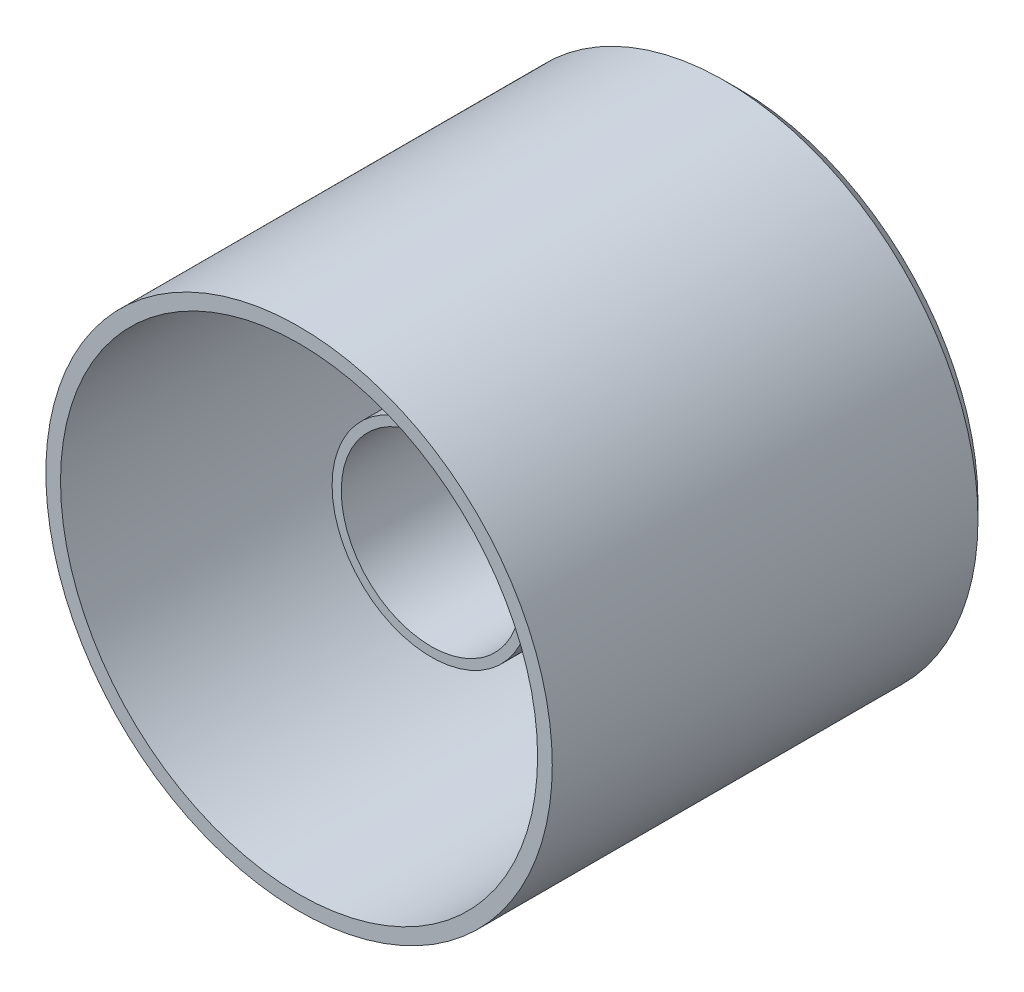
ISO-10303-21;
HEADER;
FILE_DESCRIPTION(('STEP AP214'),'2;1');
FILE_NAME('part.step','',(''),(''),'','','');
FILE_SCHEMA(('AUTOMOTIVE_DESIGN { 1 0 10303 214 1 1 1 1 }'));
ENDSEC;
DATA;
#1=APPLICATION_CONTEXT('core data for automotive mechanical design processes');
#2=APPLICATION_PROTOCOL_DEFINITION('international standard','automotive_design',2000,#1);
#3=PRODUCT_CONTEXT('',#1,'mechanical');
#4=PRODUCT('Part','Part','',(#3));
#5=PRODUCT_RELATED_PRODUCT_CATEGORY('part','',(#4));
#6=PRODUCT_DEFINITION_FORMATION('','',#4);
#7=PRODUCT_DEFINITION_CONTEXT('part definition',#1,'design');
#8=PRODUCT_DEFINITION('design','',#6,#7);
#9=PRODUCT_DEFINITION_SHAPE('','',#8);
#10=(LENGTH_UNIT() NAMED_UNIT(*) SI_UNIT(.MILLI.,.METRE.));
#11=(NAMED_UNIT(*) PLANE_ANGLE_UNIT() SI_UNIT($,.RADIAN.));
#12=(NAMED_UNIT(*) SI_UNIT($,.STERADIAN.) SOLID_ANGLE_UNIT());
#13=UNCERTAINTY_MEASURE_WITH_UNIT(LENGTH_MEASURE(1.E-05),#10,'distance_accuracy_value','');
#14=(GEOMETRIC_REPRESENTATION_CONTEXT(3) GLOBAL_UNCERTAINTY_ASSIGNED_CONTEXT((#13)) GLOBAL_UNIT_ASSIGNED_CONTEXT((#10,
#11,#12)) REPRESENTATION_CONTEXT('',''));
#15=CARTESIAN_POINT('',(0.,0.,0.));
#16=DIRECTION('',(0.,0.,1.));
#17=DIRECTION('',(1.,0.,0.));
#18=AXIS2_PLACEMENT_3D('',#15,#16,#17);
#19=CARTESIAN_POINT('',(0.,0.,2.));
#20=DIRECTION('',(0.,0.,1.));
#21=DIRECTION('',(1.,0.,0.));
#22=AXIS2_PLACEMENT_3D('',#19,#20,#21);
#23=PLANE('',#22);
#24=CARTESIAN_POINT('',(0.,0.,2.));
#25=DIRECTION('',(0.,0.,1.));
#26=DIRECTION('',(1.,0.,0.));
#27=AXIS2_PLACEMENT_3D('',#24,#25,#26);
#28=CIRCLE('',#27,32.5);
#29=CARTESIAN_POINT('',(32.5,0.,2.));
#30=VERTEX_POINT('',#29);
#31=EDGE_CURVE('E70',#30,#30,#28,.T.);
#32=ORIENTED_EDGE('',*,*,#31,.T.);
#33=EDGE_LOOP('',(#32));
#34=FACE_BOUND('',#33,.T.);
#35=CARTESIAN_POINT('',(0.,0.,2.));
#36=DIRECTION('',(0.,0.,1.));
#37=DIRECTION('',(1.,0.,0.));
#38=AXIS2_PLACEMENT_3D('',#35,#36,#37);
#39=CIRCLE('',#38,13.5);
#40=CARTESIAN_POINT('',(13.5,0.,2.));
#41=VERTEX_POINT('',#40);
#42=EDGE_CURVE('E79',#41,#41,#39,.T.);
#43=ORIENTED_EDGE('',*,*,#42,.F.);
#44=EDGE_LOOP('',(#43));
#45=FACE_BOUND('',#44,.T.);
#46=ADVANCED_FACE('F45',(#34,#45),#23,.T.);
#47=CARTESIAN_POINT('',(0.,0.,60.));
#48=DIRECTION('',(0.,0.,-1.));
#49=DIRECTION('',(-1.,0.,0.));
#50=AXIS2_PLACEMENT_3D('',#47,#48,#49);
#51=CYLINDRICAL_SURFACE('',#50,34.5);
#52=CARTESIAN_POINT('',(0.,0.,2.));
#53=DIRECTION('',(0.,0.,1.));
#54=DIRECTION('',(1.,0.,0.));
#55=AXIS2_PLACEMENT_3D('',#52,#53,#54);
#56=CIRCLE('',#55,34.5);
#57=CARTESIAN_POINT('',(34.5,0.,2.));
#58=VERTEX_POINT('',#57);
#59=EDGE_CURVE('E54',#58,#58,#56,.T.);
#60=ORIENTED_EDGE('',*,*,#59,.T.);
#61=EDGE_LOOP('',(#60));
#62=FACE_BOUND('',#61,.T.);
#63=CARTESIAN_POINT('',(0.,0.,60.));
#64=DIRECTION('',(0.,0.,1.));
#65=DIRECTION('',(1.,0.,0.));
#66=AXIS2_PLACEMENT_3D('',#63,#64,#65);
#67=CIRCLE('',#66,34.5);
#68=CARTESIAN_POINT('',(34.5,0.,60.));
#69=VERTEX_POINT('',#68);
#70=EDGE_CURVE('E59',#69,#69,#67,.T.);
#71=ORIENTED_EDGE('',*,*,#70,.F.);
#72=EDGE_LOOP('',(#71));
#73=FACE_BOUND('',#72,.T.);
#74=ADVANCED_FACE('F107',(#62,#73),#51,.T.);
#75=CARTESIAN_POINT('',(0.,0.,60.));
#76=DIRECTION('',(0.,0.,1.));
#77=DIRECTION('',(1.,0.,0.));
#78=AXIS2_PLACEMENT_3D('',#75,#76,#77);
#79=PLANE('',#78);
#80=CARTESIAN_POINT('',(0.,0.,60.));
#81=DIRECTION('',(0.,0.,1.));
#82=DIRECTION('',(1.,0.,0.));
#83=AXIS2_PLACEMENT_3D('',#80,#81,#82);
#84=CIRCLE('',#83,32.5);
#85=CARTESIAN_POINT('',(32.5,0.,60.));
#86=VERTEX_POINT('',#85);
#87=EDGE_CURVE('E64',#86,#86,#84,.T.);
#88=ORIENTED_EDGE('',*,*,#87,.F.);
#89=EDGE_LOOP('',(#88));
#90=FACE_BOUND('',#89,.T.);
#91=ORIENTED_EDGE('',*,*,#70,.T.);
#92=EDGE_LOOP('',(#91));
#93=FACE_BOUND('',#92,.T.);
#94=ADVANCED_FACE('F115',(#90,#93),#79,.T.);
#95=CARTESIAN_POINT('',(0.,0.,0.));
#96=DIRECTION('',(0.,0.,1.));
#97=DIRECTION('',(1.,0.,0.));
#98=AXIS2_PLACEMENT_3D('',#95,#96,#97);
#99=PLANE('',#98);
#100=CARTESIAN_POINT('',(0.,0.,0.));
#101=DIRECTION('',(0.,0.,-1.));
#102=DIRECTION('',(-1.,0.,0.));
#103=AXIS2_PLACEMENT_3D('',#100,#101,#102);
#104=CIRCLE('',#103,12.25);
#105=CARTESIAN_POINT('',(-12.25,0.,0.));
#106=VERTEX_POINT('',#105);
#107=EDGE_CURVE('E74',#106,#106,#104,.T.);
#108=ORIENTED_EDGE('',*,*,#107,.F.);
#109=EDGE_LOOP('',(#108));
#110=FACE_BOUND('',#109,.T.);
#111=CARTESIAN_POINT('',(0.,0.,0.));
#112=DIRECTION('',(0.,0.,1.));
#113=DIRECTION('',(1.,0.,0.));
#114=AXIS2_PLACEMENT_3D('',#111,#112,#113);
#115=CIRCLE('',#114,32.5);
#116=CARTESIAN_POINT('',(32.5,0.,0.));
#117=VERTEX_POINT('',#116);
#118=EDGE_CURVE('E10',#117,#117,#115,.F.);
#119=ORIENTED_EDGE('',*,*,#118,.T.);
#120=EDGE_LOOP('',(#119));
#121=FACE_BOUND('',#120,.T.);
#122=ADVANCED_FACE('F122',(#110,#121),#99,.F.);
#123=CARTESIAN_POINT('',(0.,0.,60.));
#124=DIRECTION('',(0.,0.,-1.));
#125=DIRECTION('',(-1.,0.,0.));
#126=AXIS2_PLACEMENT_3D('',#123,#124,#125);
#127=CYLINDRICAL_SURFACE('',#126,32.5);
#128=ORIENTED_EDGE('',*,*,#87,.T.);
#129=EDGE_LOOP('',(#128));
#130=FACE_BOUND('',#129,.T.);
#131=ORIENTED_EDGE('',*,*,#31,.F.);
#132=EDGE_LOOP('',(#131));
#133=FACE_BOUND('',#132,.T.);
#134=ADVANCED_FACE('F119',(#130,#133),#127,.F.);
#135=CARTESIAN_POINT('',(0.,0.,2.));
#136=DIRECTION('',(0.,0.,1.));
#137=DIRECTION('',(1.,0.,0.));
#138=AXIS2_PLACEMENT_3D('',#135,#136,#137);
#139=CONICAL_SURFACE('',#138,34.5,0.785398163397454);
#140=ORIENTED_EDGE('',*,*,#118,.F.);
#141=EDGE_LOOP('',(#140));
#142=FACE_BOUND('',#141,.T.);
#143=ORIENTED_EDGE('',*,*,#59,.F.);
#144=EDGE_LOOP('',(#143));
#145=FACE_BOUND('',#144,.T.);
#146=ADVANCED_FACE('F48',(#142,#145),#139,.T.);
#147=CARTESIAN_POINT('',(0.,0.,5.));
#148=DIRECTION('',(0.,0.,-1.));
#149=DIRECTION('',(-1.,0.,0.));
#150=AXIS2_PLACEMENT_3D('',#147,#148,#149);
#151=CYLINDRICAL_SURFACE('',#150,12.25);
#152=ORIENTED_EDGE('',*,*,#107,.T.);
#153=EDGE_LOOP('',(#152));
#154=FACE_BOUND('',#153,.T.);
#155=CARTESIAN_POINT('',(0.,0.,42.));
#156=DIRECTION('',(0.,0.,1.));
#157=DIRECTION('',(1.,0.,0.));
#158=AXIS2_PLACEMENT_3D('',#155,#156,#157);
#159=CIRCLE('',#158,12.25);
#160=CARTESIAN_POINT('',(12.25,0.,42.));
#161=VERTEX_POINT('',#160);
#162=EDGE_CURVE('E83',#161,#161,#159,.T.);
#163=ORIENTED_EDGE('',*,*,#162,.T.);
#164=EDGE_LOOP('',(#163));
#165=FACE_BOUND('',#164,.T.);
#166=ADVANCED_FACE('F91',(#154,#165),#151,.F.);
#167=CARTESIAN_POINT('',(0.,0.,42.));
#168=DIRECTION('',(0.,0.,1.));
#169=DIRECTION('',(1.,0.,0.));
#170=AXIS2_PLACEMENT_3D('',#167,#168,#169);
#171=PLANE('',#170);
#172=CARTESIAN_POINT('',(0.,0.,42.));
#173=DIRECTION('',(0.,0.,1.));
#174=DIRECTION('',(1.,0.,0.));
#175=AXIS2_PLACEMENT_3D('',#172,#173,#174);
#176=CIRCLE('',#175,13.5);
#177=CARTESIAN_POINT('',(13.5,0.,42.));
#178=VERTEX_POINT('',#177);
#179=EDGE_CURVE('E78',#178,#178,#176,.T.);
#180=ORIENTED_EDGE('',*,*,#179,.T.);
#181=EDGE_LOOP('',(#180));
#182=FACE_BOUND('',#181,.T.);
#183=ORIENTED_EDGE('',*,*,#162,.F.);
#184=EDGE_LOOP('',(#183));
#185=FACE_BOUND('',#184,.T.);
#186=ADVANCED_FACE('F93',(#182,#185),#171,.T.);
#187=CARTESIAN_POINT('',(0.,0.,42.));
#188=DIRECTION('',(0.,0.,-1.));
#189=DIRECTION('',(-1.,0.,0.));
#190=AXIS2_PLACEMENT_3D('',#187,#188,#189);
#191=CYLINDRICAL_SURFACE('',#190,13.5);
#192=ORIENTED_EDGE('',*,*,#179,.F.);
#193=EDGE_LOOP('',(#192));
#194=FACE_BOUND('',#193,.T.);
#195=ORIENTED_EDGE('',*,*,#42,.T.);
#196=EDGE_LOOP('',(#195));
#197=FACE_BOUND('',#196,.T.);
#198=ADVANCED_FACE('F95',(#194,#197),#191,.T.);
#199=CLOSED_SHELL('',(#46,#74,#94,#122,#134,#146,#166,#186,#198));
#200=MANIFOLD_SOLID_BREP('B2',#199);
#201=ADVANCED_BREP_SHAPE_REPRESENTATION('',(#18,#200),#14);
#202=SHAPE_DEFINITION_REPRESENTATION(#9,#201);
ENDSEC;
END-ISO-10303-21;
